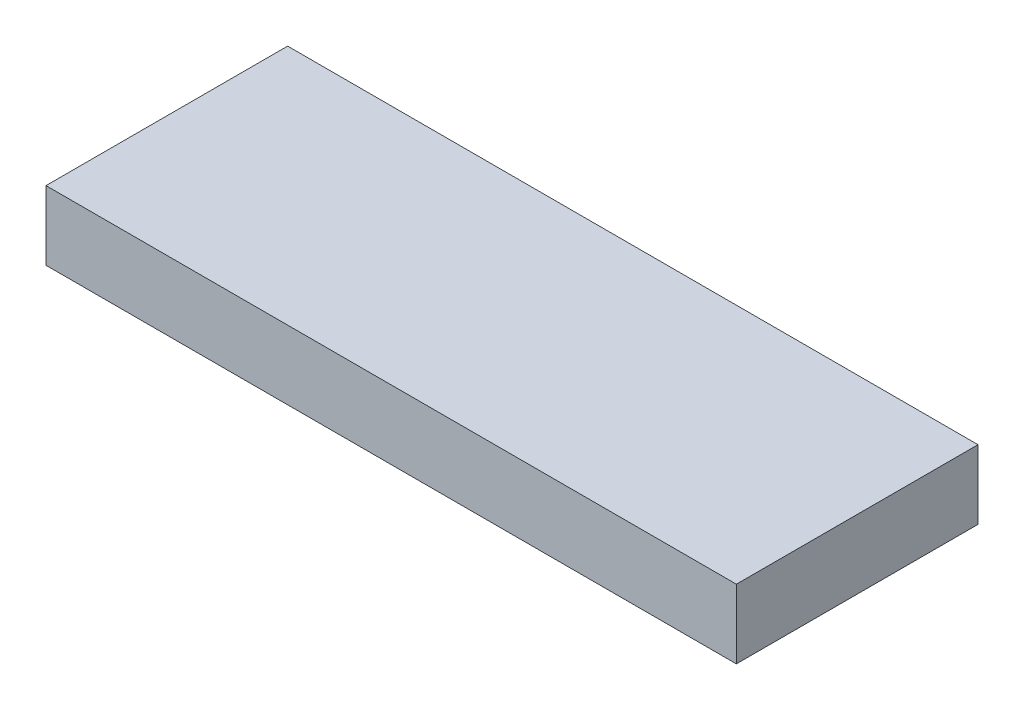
ISO-10303-21;
HEADER;
FILE_DESCRIPTION(('STEP AP214'),'2;1');
FILE_NAME('part.step','',(''),(''),'','','');
FILE_SCHEMA(('AUTOMOTIVE_DESIGN { 1 0 10303 214 1 1 1 1 }'));
ENDSEC;
DATA;
#1=APPLICATION_CONTEXT('core data for automotive mechanical design processes');
#2=APPLICATION_PROTOCOL_DEFINITION('international standard','automotive_design',2000,#1);
#3=PRODUCT_CONTEXT('',#1,'mechanical');
#4=PRODUCT('Part','Part','',(#3));
#5=PRODUCT_RELATED_PRODUCT_CATEGORY('part','',(#4));
#6=PRODUCT_DEFINITION_FORMATION('','',#4);
#7=PRODUCT_DEFINITION_CONTEXT('part definition',#1,'design');
#8=PRODUCT_DEFINITION('design','',#6,#7);
#9=PRODUCT_DEFINITION_SHAPE('','',#8);
#10=(LENGTH_UNIT() NAMED_UNIT(*) SI_UNIT(.MILLI.,.METRE.));
#11=(NAMED_UNIT(*) PLANE_ANGLE_UNIT() SI_UNIT($,.RADIAN.));
#12=(NAMED_UNIT(*) SI_UNIT($,.STERADIAN.) SOLID_ANGLE_UNIT());
#13=UNCERTAINTY_MEASURE_WITH_UNIT(LENGTH_MEASURE(1.E-05),#10,'distance_accuracy_value','');
#14=(GEOMETRIC_REPRESENTATION_CONTEXT(3) GLOBAL_UNCERTAINTY_ASSIGNED_CONTEXT((#13)) GLOBAL_UNIT_ASSIGNED_CONTEXT((#10,
#11,#12)) REPRESENTATION_CONTEXT('',''));
#15=CARTESIAN_POINT('',(0.,0.,0.));
#16=DIRECTION('',(0.,0.,1.));
#17=DIRECTION('',(1.,0.,0.));
#18=AXIS2_PLACEMENT_3D('',#15,#16,#17);
#19=CARTESIAN_POINT('',(500.,100.,175.));
#20=DIRECTION('',(-1.,0.,0.));
#21=DIRECTION('',(0.,0.,1.));
#22=AXIS2_PLACEMENT_3D('',#19,#20,#21);
#23=PLANE('',#22);
#24=DIRECTION('',(0.,0.,-1.));
#25=VECTOR('',#24,1.);
#26=CARTESIAN_POINT('',(500.,0.,175.));
#27=LINE('',#26,#25);
#28=CARTESIAN_POINT('',(500.,0.,175.));
#29=VERTEX_POINT('',#28);
#30=CARTESIAN_POINT('',(500.,0.,-175.));
#31=VERTEX_POINT('',#30);
#32=EDGE_CURVE('E100',#29,#31,#27,.T.);
#33=ORIENTED_EDGE('',*,*,#32,.T.);
#34=DIRECTION('',(0.,-1.,0.));
#35=VECTOR('',#34,1.);
#36=CARTESIAN_POINT('',(500.,100.,-175.));
#37=LINE('',#36,#35);
#38=CARTESIAN_POINT('',(500.,100.,-175.));
#39=VERTEX_POINT('',#38);
#40=EDGE_CURVE('E11',#39,#31,#37,.T.);
#41=ORIENTED_EDGE('',*,*,#40,.F.);
#42=DIRECTION('',(0.,0.,-1.));
#43=VECTOR('',#42,1.);
#44=CARTESIAN_POINT('',(500.,100.,175.));
#45=LINE('',#44,#43);
#46=CARTESIAN_POINT('',(500.,100.,175.));
#47=VERTEX_POINT('',#46);
#48=EDGE_CURVE('E88',#47,#39,#45,.T.);
#49=ORIENTED_EDGE('',*,*,#48,.F.);
#50=DIRECTION('',(0.,-1.,0.));
#51=VECTOR('',#50,1.);
#52=CARTESIAN_POINT('',(500.,100.,175.));
#53=LINE('',#52,#51);
#54=EDGE_CURVE('E96',#47,#29,#53,.T.);
#55=ORIENTED_EDGE('',*,*,#54,.T.);
#56=EDGE_LOOP('',(#33,#41,#49,#55));
#57=FACE_BOUND('',#56,.T.);
#58=ADVANCED_FACE('F37',(#57),#23,.F.);
#59=CARTESIAN_POINT('',(-500.,100.,-175.));
#60=DIRECTION('',(0.,0.,1.));
#61=DIRECTION('',(1.,0.,0.));
#62=AXIS2_PLACEMENT_3D('',#59,#60,#61);
#63=PLANE('',#62);
#64=DIRECTION('',(-1.,0.,0.));
#65=VECTOR('',#64,1.);
#66=CARTESIAN_POINT('',(-500.,0.,-175.));
#67=LINE('',#66,#65);
#68=CARTESIAN_POINT('',(-500.,0.,-175.));
#69=VERTEX_POINT('',#68);
#70=EDGE_CURVE('E92',#31,#69,#67,.T.);
#71=ORIENTED_EDGE('',*,*,#70,.T.);
#72=DIRECTION('',(0.,-1.,0.));
#73=VECTOR('',#72,1.);
#74=CARTESIAN_POINT('',(-500.,100.,-175.));
#75=LINE('',#74,#73);
#76=CARTESIAN_POINT('',(-500.,100.,-175.));
#77=VERTEX_POINT('',#76);
#78=EDGE_CURVE('E45',#77,#69,#75,.T.);
#79=ORIENTED_EDGE('',*,*,#78,.F.);
#80=DIRECTION('',(-1.,0.,0.));
#81=VECTOR('',#80,1.);
#82=CARTESIAN_POINT('',(-500.,100.,-175.));
#83=LINE('',#82,#81);
#84=EDGE_CURVE('E83',#39,#77,#83,.T.);
#85=ORIENTED_EDGE('',*,*,#84,.F.);
#86=ORIENTED_EDGE('',*,*,#40,.T.);
#87=EDGE_LOOP('',(#71,#79,#85,#86));
#88=FACE_BOUND('',#87,.T.);
#89=ADVANCED_FACE('F91',(#88),#63,.F.);
#90=CARTESIAN_POINT('',(-500.,100.,175.));
#91=DIRECTION('',(1.,0.,0.));
#92=DIRECTION('',(0.,0.,-1.));
#93=AXIS2_PLACEMENT_3D('',#90,#91,#92);
#94=PLANE('',#93);
#95=DIRECTION('',(0.,0.,1.));
#96=VECTOR('',#95,1.);
#97=CARTESIAN_POINT('',(-500.,0.,175.));
#98=LINE('',#97,#96);
#99=CARTESIAN_POINT('',(-500.,0.,175.));
#100=VERTEX_POINT('',#99);
#101=EDGE_CURVE('E70',#69,#100,#98,.T.);
#102=ORIENTED_EDGE('',*,*,#101,.T.);
#103=DIRECTION('',(0.,-1.,0.));
#104=VECTOR('',#103,1.);
#105=CARTESIAN_POINT('',(-500.,100.,175.));
#106=LINE('',#105,#104);
#107=CARTESIAN_POINT('',(-500.,100.,175.));
#108=VERTEX_POINT('',#107);
#109=EDGE_CURVE('E93',#108,#100,#106,.T.);
#110=ORIENTED_EDGE('',*,*,#109,.F.);
#111=DIRECTION('',(0.,0.,1.));
#112=VECTOR('',#111,1.);
#113=CARTESIAN_POINT('',(-500.,100.,175.));
#114=LINE('',#113,#112);
#115=EDGE_CURVE('E86',#77,#108,#114,.T.);
#116=ORIENTED_EDGE('',*,*,#115,.F.);
#117=ORIENTED_EDGE('',*,*,#78,.T.);
#118=EDGE_LOOP('',(#102,#110,#116,#117));
#119=FACE_BOUND('',#118,.T.);
#120=ADVANCED_FACE('F94',(#119),#94,.F.);
#121=CARTESIAN_POINT('',(-500.,100.,175.));
#122=DIRECTION('',(0.,0.,-1.));
#123=DIRECTION('',(-1.,0.,0.));
#124=AXIS2_PLACEMENT_3D('',#121,#122,#123);
#125=PLANE('',#124);
#126=DIRECTION('',(1.,0.,0.));
#127=VECTOR('',#126,1.);
#128=CARTESIAN_POINT('',(-500.,0.,175.));
#129=LINE('',#128,#127);
#130=EDGE_CURVE('E76',#100,#29,#129,.T.);
#131=ORIENTED_EDGE('',*,*,#130,.T.);
#132=ORIENTED_EDGE('',*,*,#54,.F.);
#133=DIRECTION('',(1.,0.,0.));
#134=VECTOR('',#133,1.);
#135=CARTESIAN_POINT('',(-500.,100.,175.));
#136=LINE('',#135,#134);
#137=EDGE_CURVE('E53',#108,#47,#136,.T.);
#138=ORIENTED_EDGE('',*,*,#137,.F.);
#139=ORIENTED_EDGE('',*,*,#109,.T.);
#140=EDGE_LOOP('',(#131,#132,#138,#139));
#141=FACE_BOUND('',#140,.T.);
#142=ADVANCED_FACE('F107',(#141),#125,.F.);
#143=CARTESIAN_POINT('',(0.,100.,0.));
#144=DIRECTION('',(0.,-1.,0.));
#145=DIRECTION('',(0.,0.,-1.));
#146=AXIS2_PLACEMENT_3D('',#143,#144,#145);
#147=PLANE('',#146);
#148=ORIENTED_EDGE('',*,*,#48,.T.);
#149=ORIENTED_EDGE('',*,*,#84,.T.);
#150=ORIENTED_EDGE('',*,*,#115,.T.);
#151=ORIENTED_EDGE('',*,*,#137,.T.);
#152=EDGE_LOOP('',(#148,#149,#150,#151));
#153=FACE_BOUND('',#152,.T.);
#154=ADVANCED_FACE('F84',(#153),#147,.F.);
#155=CARTESIAN_POINT('',(0.,0.,0.));
#156=DIRECTION('',(0.,-1.,0.));
#157=DIRECTION('',(0.,0.,-1.));
#158=AXIS2_PLACEMENT_3D('',#155,#156,#157);
#159=PLANE('',#158);
#160=ORIENTED_EDGE('',*,*,#32,.F.);
#161=ORIENTED_EDGE('',*,*,#130,.F.);
#162=ORIENTED_EDGE('',*,*,#101,.F.);
#163=ORIENTED_EDGE('',*,*,#70,.F.);
#164=EDGE_LOOP('',(#160,#161,#162,#163));
#165=FACE_BOUND('',#164,.T.);
#166=ADVANCED_FACE('F110',(#165),#159,.T.);
#167=CLOSED_SHELL('',(#58,#89,#120,#142,#154,#166));
#168=MANIFOLD_SOLID_BREP('B2',#167);
#169=ADVANCED_BREP_SHAPE_REPRESENTATION('',(#18,#168),#14);
#170=SHAPE_DEFINITION_REPRESENTATION(#9,#169);
ENDSEC;
END-ISO-10303-21;
